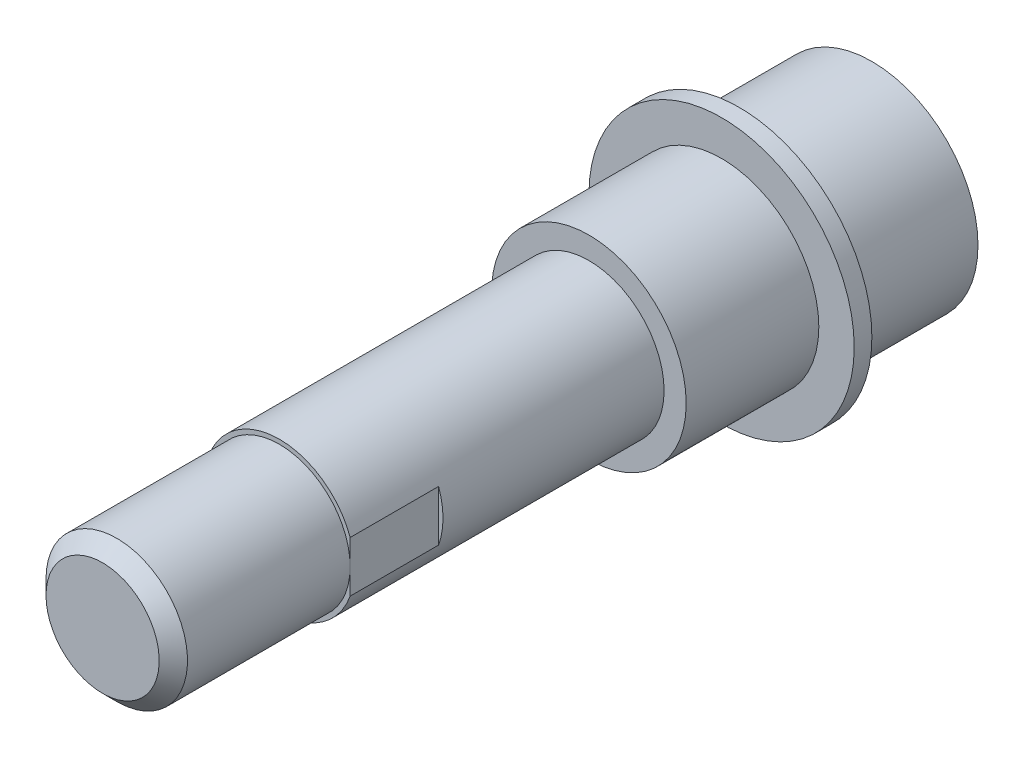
from build123d import *

# Parameters (mm, degrees)
CHANFREIN1_SIZE  = 1.6
EXTRUSION1_START = -10
EXTRUSION1_DEPTH = 10


with BuildPart() as part:
    # Esquisse1 → R_volution1 (revolve)
    with BuildSketch(Plane(origin=(0, 0, 0), x_dir=(0, 0, -1), z_dir=(1, 0, 0)), mode=Mode.PRIVATE) as r_volution1_sk:
        Polygon((0, 0), (0, 8), (20, 8), (20, 8.5), (55, 8.5), (55, 11), (70, 11), (70, 15), (72, 15), (72, 12), (87, 12), (87, 0), align=None)
    revolve(r_volution1_sk.sketch.rotate(Axis((0, 0, 0), (0, 0, -1)), 90), axis=Axis((0, 0, 0), (0, 0, -1)))

    # Chanfrein1
    chanfrein1_edges = [part.edges().sort_by_distance(p)[0] for p in [
        (-8, 0, 0),
    ]]
    chamfer(chanfrein1_edges, length=CHANFREIN1_SIZE)

    # Esquisse2 → Extrusion1 (cut)
    with BuildSketch(Plane.XY.offset(-20).offset(EXTRUSION1_START)):
        with BuildLine():
            Line((8, 2.872281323), (8, -2.872281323))
            ThreePointArc((8, -2.872281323), (8.5, 0), (8, 2.872281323))
        make_face()
    extrusion1 = extrude(amount=EXTRUSION1_DEPTH, mode=Mode.SUBTRACT)

    # Sym_trie1: Extrusion1 across plane
    add(extrusion1.mirror(Plane(origin=(0, 0, 0), x_dir=(0, 0, 1), z_dir=(1, 0, 0))), mode=Mode.SUBTRACT)


solid = part.part
